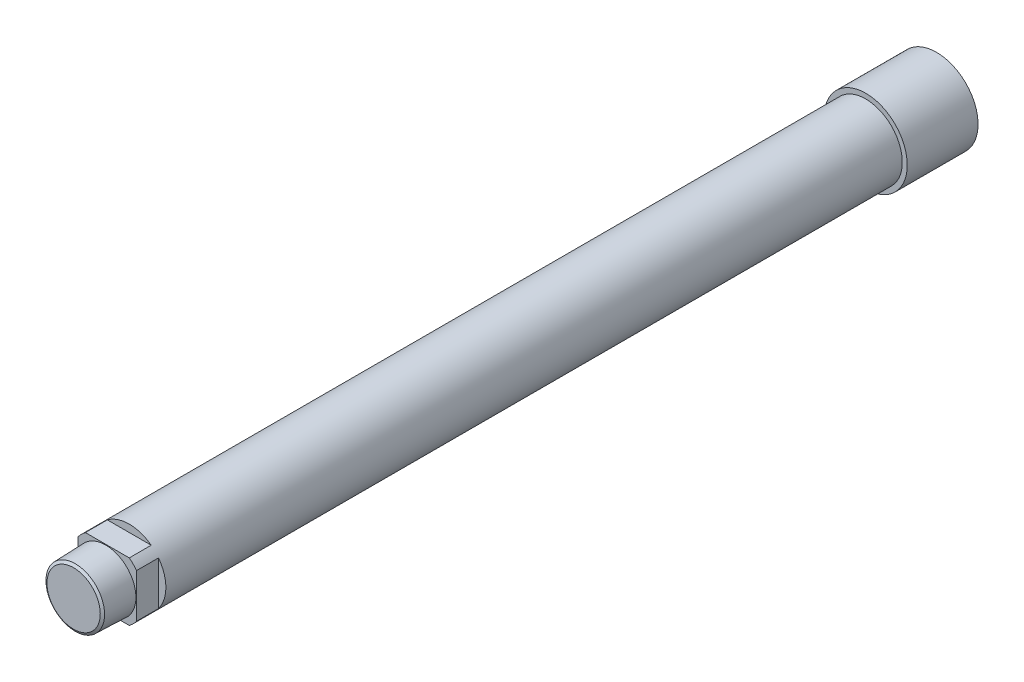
ISO-10303-21;
HEADER;
FILE_DESCRIPTION(('STEP AP214'),'2;1');
FILE_NAME('part.step','',(''),(''),'','','');
FILE_SCHEMA(('AUTOMOTIVE_DESIGN { 1 0 10303 214 1 1 1 1 }'));
ENDSEC;
DATA;
#1=APPLICATION_CONTEXT('core data for automotive mechanical design processes');
#2=APPLICATION_PROTOCOL_DEFINITION('international standard','automotive_design',2000,#1);
#3=PRODUCT_CONTEXT('',#1,'mechanical');
#4=PRODUCT('Part','Part','',(#3));
#5=PRODUCT_RELATED_PRODUCT_CATEGORY('part','',(#4));
#6=PRODUCT_DEFINITION_FORMATION('','',#4);
#7=PRODUCT_DEFINITION_CONTEXT('part definition',#1,'design');
#8=PRODUCT_DEFINITION('design','',#6,#7);
#9=PRODUCT_DEFINITION_SHAPE('','',#8);
#10=(LENGTH_UNIT() NAMED_UNIT(*) SI_UNIT(.MILLI.,.METRE.));
#11=(NAMED_UNIT(*) PLANE_ANGLE_UNIT() SI_UNIT($,.RADIAN.));
#12=(NAMED_UNIT(*) SI_UNIT($,.STERADIAN.) SOLID_ANGLE_UNIT());
#13=UNCERTAINTY_MEASURE_WITH_UNIT(LENGTH_MEASURE(1.E-05),#10,'distance_accuracy_value','');
#14=(GEOMETRIC_REPRESENTATION_CONTEXT(3) GLOBAL_UNCERTAINTY_ASSIGNED_CONTEXT((#13)) GLOBAL_UNIT_ASSIGNED_CONTEXT((#10,
#11,#12)) REPRESENTATION_CONTEXT('',''));
#15=CARTESIAN_POINT('',(0.,0.,0.));
#16=DIRECTION('',(0.,0.,1.));
#17=DIRECTION('',(1.,0.,0.));
#18=AXIS2_PLACEMENT_3D('',#15,#16,#17);
#19=CARTESIAN_POINT('',(0.,0.,343.789));
#20=DIRECTION('',(0.,0.,-1.));
#21=DIRECTION('',(-1.,0.,0.));
#22=AXIS2_PLACEMENT_3D('',#19,#20,#21);
#23=CYLINDRICAL_SURFACE('',#22,15.875);
#24=CARTESIAN_POINT('',(0.,0.,0.));
#25=DIRECTION('',(0.,0.,-1.));
#26=DIRECTION('',(-1.,0.,0.));
#27=AXIS2_PLACEMENT_3D('',#24,#25,#26);
#28=CIRCLE('',#27,15.875);
#29=CARTESIAN_POINT('',(-15.875,0.,0.));
#30=VERTEX_POINT('',#29);
#31=EDGE_CURVE('E204',#30,#30,#28,.T.);
#32=ORIENTED_EDGE('',*,*,#31,.F.);
#33=EDGE_LOOP('',(#32));
#34=FACE_BOUND('',#33,.T.);
#35=CARTESIAN_POINT('',(0.,0.,319.6336));
#36=DIRECTION('',(0.,0.,1.));
#37=DIRECTION('',(1.,0.,0.));
#38=AXIS2_PLACEMENT_3D('',#35,#36,#37);
#39=CIRCLE('',#38,15.875);
#40=CARTESIAN_POINT('',(9.52499999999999,12.7,319.6336));
#41=VERTEX_POINT('',#40);
#42=CARTESIAN_POINT('',(-9.52499999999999,12.7,319.6336));
#43=VERTEX_POINT('',#42);
#44=EDGE_CURVE('E49',#41,#43,#39,.T.);
#45=ORIENTED_EDGE('',*,*,#44,.F.);
#46=DIRECTION('',(0.,0.,-1.));
#47=VECTOR('',#46,1.);
#48=CARTESIAN_POINT('',(9.52499999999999,12.7,343.789));
#49=LINE('',#48,#47);
#50=CARTESIAN_POINT('',(9.52499999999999,12.7,329.1586));
#51=VERTEX_POINT('',#50);
#52=EDGE_CURVE('E160',#51,#41,#49,.T.);
#53=ORIENTED_EDGE('',*,*,#52,.F.);
#54=CARTESIAN_POINT('',(0.,0.,329.1586));
#55=DIRECTION('',(0.,0.,1.));
#56=DIRECTION('',(1.,0.,0.));
#57=AXIS2_PLACEMENT_3D('',#54,#55,#56);
#58=CIRCLE('',#57,15.875);
#59=CARTESIAN_POINT('',(12.7,9.525,329.1586));
#60=VERTEX_POINT('',#59);
#61=EDGE_CURVE('E128',#60,#51,#58,.T.);
#62=ORIENTED_EDGE('',*,*,#61,.F.);
#63=DIRECTION('',(0.,0.,-1.));
#64=VECTOR('',#63,1.);
#65=CARTESIAN_POINT('',(12.7,9.52500000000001,343.789));
#66=LINE('',#65,#64);
#67=CARTESIAN_POINT('',(12.7,9.52500000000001,319.6336));
#68=VERTEX_POINT('',#67);
#69=EDGE_CURVE('E121',#68,#60,#66,.F.);
#70=ORIENTED_EDGE('',*,*,#69,.F.);
#71=CARTESIAN_POINT('',(12.7,-9.52500000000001,319.6336));
#72=VERTEX_POINT('',#71);
#73=EDGE_CURVE('E141',#72,#68,#39,.T.);
#74=ORIENTED_EDGE('',*,*,#73,.F.);
#75=DIRECTION('',(0.,0.,-1.));
#76=VECTOR('',#75,1.);
#77=CARTESIAN_POINT('',(12.7,-9.52500000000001,343.789));
#78=LINE('',#77,#76);
#79=CARTESIAN_POINT('',(12.7,-9.525,329.1586));
#80=VERTEX_POINT('',#79);
#81=EDGE_CURVE('E161',#80,#72,#78,.T.);
#82=ORIENTED_EDGE('',*,*,#81,.F.);
#83=CARTESIAN_POINT('',(9.52500000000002,-12.7,329.1586));
#84=VERTEX_POINT('',#83);
#85=EDGE_CURVE('E126',#84,#80,#58,.T.);
#86=ORIENTED_EDGE('',*,*,#85,.F.);
#87=DIRECTION('',(0.,0.,-1.));
#88=VECTOR('',#87,1.);
#89=CARTESIAN_POINT('',(9.52500000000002,-12.7,343.789));
#90=LINE('',#89,#88);
#91=CARTESIAN_POINT('',(9.52500000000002,-12.7,319.6336));
#92=VERTEX_POINT('',#91);
#93=EDGE_CURVE('E109',#92,#84,#90,.F.);
#94=ORIENTED_EDGE('',*,*,#93,.F.);
#95=CARTESIAN_POINT('',(-9.52500000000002,-12.7,319.6336));
#96=VERTEX_POINT('',#95);
#97=EDGE_CURVE('E44',#96,#92,#39,.T.);
#98=ORIENTED_EDGE('',*,*,#97,.F.);
#99=DIRECTION('',(0.,0.,-1.));
#100=VECTOR('',#99,1.);
#101=CARTESIAN_POINT('',(-9.52500000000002,-12.7,343.789));
#102=LINE('',#101,#100);
#103=CARTESIAN_POINT('',(-9.52500000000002,-12.7,329.1586));
#104=VERTEX_POINT('',#103);
#105=EDGE_CURVE('E106',#104,#96,#102,.T.);
#106=ORIENTED_EDGE('',*,*,#105,.F.);
#107=CARTESIAN_POINT('',(-12.7,-9.525,329.1586));
#108=VERTEX_POINT('',#107);
#109=EDGE_CURVE('E119',#108,#104,#58,.T.);
#110=ORIENTED_EDGE('',*,*,#109,.F.);
#111=DIRECTION('',(0.,0.,-1.));
#112=VECTOR('',#111,1.);
#113=CARTESIAN_POINT('',(-12.7,-9.52500000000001,343.789));
#114=LINE('',#113,#112);
#115=CARTESIAN_POINT('',(-12.7,-9.52500000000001,319.6336));
#116=VERTEX_POINT('',#115);
#117=EDGE_CURVE('E163',#116,#108,#114,.F.);
#118=ORIENTED_EDGE('',*,*,#117,.F.);
#119=CARTESIAN_POINT('',(-12.7,9.52500000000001,319.6336));
#120=VERTEX_POINT('',#119);
#121=EDGE_CURVE('E12',#120,#116,#39,.T.);
#122=ORIENTED_EDGE('',*,*,#121,.F.);
#123=DIRECTION('',(0.,0.,-1.));
#124=VECTOR('',#123,1.);
#125=CARTESIAN_POINT('',(-12.7,9.52500000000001,343.789));
#126=LINE('',#125,#124);
#127=CARTESIAN_POINT('',(-12.7,9.525,329.1586));
#128=VERTEX_POINT('',#127);
#129=EDGE_CURVE('E169',#128,#120,#126,.T.);
#130=ORIENTED_EDGE('',*,*,#129,.F.);
#131=CARTESIAN_POINT('',(-9.52499999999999,12.7,329.1586));
#132=VERTEX_POINT('',#131);
#133=EDGE_CURVE('E125',#132,#128,#58,.T.);
#134=ORIENTED_EDGE('',*,*,#133,.F.);
#135=DIRECTION('',(0.,0.,-1.));
#136=VECTOR('',#135,1.);
#137=CARTESIAN_POINT('',(-9.52499999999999,12.7,343.789));
#138=LINE('',#137,#136);
#139=EDGE_CURVE('E157',#43,#132,#138,.F.);
#140=ORIENTED_EDGE('',*,*,#139,.F.);
#141=EDGE_LOOP('',(#45,#53,#62,#70,#74,#82,#86,#94,#98,#106,#110,#118,#122,#130,#134,#140));
#142=FACE_BOUND('',#141,.T.);
#143=ADVANCED_FACE('F41',(#34,#142),#23,.T.);
#144=CARTESIAN_POINT('',(0.,12.0243668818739,329.1586));
#145=DIRECTION('',(0.,0.,1.));
#146=DIRECTION('',(1.,0.,0.));
#147=AXIS2_PLACEMENT_3D('',#144,#145,#146);
#148=PLANE('',#147);
#149=DIRECTION('',(1.,0.,0.));
#150=VECTOR('',#149,1.);
#151=CARTESIAN_POINT('',(0.,-12.7,329.1586));
#152=LINE('',#151,#150);
#153=EDGE_CURVE('E56',#104,#84,#152,.T.);
#154=ORIENTED_EDGE('',*,*,#153,.T.);
#155=ORIENTED_EDGE('',*,*,#85,.T.);
#156=DIRECTION('',(0.,1.,0.));
#157=VECTOR('',#156,1.);
#158=CARTESIAN_POINT('',(12.7,12.0243668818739,329.1586));
#159=LINE('',#158,#157);
#160=EDGE_CURVE('E111',#80,#60,#159,.T.);
#161=ORIENTED_EDGE('',*,*,#160,.T.);
#162=ORIENTED_EDGE('',*,*,#61,.T.);
#163=DIRECTION('',(-1.,0.,0.));
#164=VECTOR('',#163,1.);
#165=CARTESIAN_POINT('',(0.,12.7,329.1586));
#166=LINE('',#165,#164);
#167=EDGE_CURVE('E140',#51,#132,#166,.T.);
#168=ORIENTED_EDGE('',*,*,#167,.T.);
#169=ORIENTED_EDGE('',*,*,#133,.T.);
#170=DIRECTION('',(0.,-1.,0.));
#171=VECTOR('',#170,1.);
#172=CARTESIAN_POINT('',(-12.7,12.0243668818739,329.1586));
#173=LINE('',#172,#171);
#174=EDGE_CURVE('E62',#128,#108,#173,.T.);
#175=ORIENTED_EDGE('',*,*,#174,.T.);
#176=ORIENTED_EDGE('',*,*,#109,.T.);
#177=EDGE_LOOP('',(#154,#155,#161,#162,#168,#169,#175,#176));
#178=FACE_BOUND('',#177,.T.);
#179=CARTESIAN_POINT('',(0.,0.,329.1586));
#180=DIRECTION('',(0.,0.,1.));
#181=DIRECTION('',(1.,0.,0.));
#182=AXIS2_PLACEMENT_3D('',#179,#180,#181);
#183=CIRCLE('',#182,12.0243668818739);
#184=CARTESIAN_POINT('',(12.0243668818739,0.,329.1586));
#185=VERTEX_POINT('',#184);
#186=EDGE_CURVE('E133',#185,#185,#183,.T.);
#187=ORIENTED_EDGE('',*,*,#186,.F.);
#188=EDGE_LOOP('',(#187));
#189=FACE_BOUND('',#188,.T.);
#190=ADVANCED_FACE('F123',(#178,#189),#148,.T.);
#191=CARTESIAN_POINT('',(0.,0.,330.073));
#192=DIRECTION('',(0.,0.,1.));
#193=DIRECTION('',(1.,0.,0.));
#194=AXIS2_PLACEMENT_3D('',#191,#192,#193);
#195=CONICAL_SURFACE('',#194,13.443750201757,0.998492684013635);
#196=ORIENTED_EDGE('',*,*,#186,.T.);
#197=EDGE_LOOP('',(#196));
#198=FACE_BOUND('',#197,.T.);
#199=CARTESIAN_POINT('',(0.,0.,329.87247368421));
#200=DIRECTION('',(0.,0.,-1.));
#201=DIRECTION('',(-1.,0.,0.));
#202=AXIS2_PLACEMENT_3D('',#199,#200,#201);
#203=CIRCLE('',#202,13.1324819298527);
#204=CARTESIAN_POINT('',(-13.1324819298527,0.,329.87247368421));
#205=VERTEX_POINT('',#204);
#206=EDGE_CURVE('E170',#205,#205,#203,.T.);
#207=ORIENTED_EDGE('',*,*,#206,.T.);
#208=EDGE_LOOP('',(#207));
#209=FACE_BOUND('',#208,.T.);
#210=ADVANCED_FACE('F201',(#198,#209),#195,.T.);
#211=CARTESIAN_POINT('',(-12.7,-12.7,319.6336));
#212=DIRECTION('',(0.,-1.,0.));
#213=DIRECTION('',(0.,0.,-1.));
#214=AXIS2_PLACEMENT_3D('',#211,#212,#213);
#215=PLANE('',#214);
#216=DIRECTION('',(1.,0.,0.));
#217=VECTOR('',#216,1.);
#218=CARTESIAN_POINT('',(-12.7,-12.7,319.6336));
#219=LINE('',#218,#217);
#220=EDGE_CURVE('E209',#96,#92,#219,.T.);
#221=ORIENTED_EDGE('',*,*,#220,.T.);
#222=ORIENTED_EDGE('',*,*,#93,.T.);
#223=ORIENTED_EDGE('',*,*,#153,.F.);
#224=ORIENTED_EDGE('',*,*,#105,.T.);
#225=EDGE_LOOP('',(#221,#222,#223,#224));
#226=FACE_BOUND('',#225,.T.);
#227=ADVANCED_FACE('F105',(#226),#215,.T.);
#228=CARTESIAN_POINT('',(0.,0.,319.6336));
#229=DIRECTION('',(0.,0.,1.));
#230=DIRECTION('',(1.,0.,0.));
#231=AXIS2_PLACEMENT_3D('',#228,#229,#230);
#232=PLANE('',#231);
#233=ORIENTED_EDGE('',*,*,#97,.T.);
#234=ORIENTED_EDGE('',*,*,#220,.F.);
#235=EDGE_LOOP('',(#233,#234));
#236=FACE_BOUND('',#235,.T.);
#237=ADVANCED_FACE('F228',(#236),#232,.T.);
#238=CARTESIAN_POINT('',(12.7,-12.7,319.6336));
#239=DIRECTION('',(1.,0.,0.));
#240=DIRECTION('',(0.,0.,-1.));
#241=AXIS2_PLACEMENT_3D('',#238,#239,#240);
#242=PLANE('',#241);
#243=DIRECTION('',(0.,1.,0.));
#244=VECTOR('',#243,1.);
#245=CARTESIAN_POINT('',(12.7,-12.7,319.6336));
#246=LINE('',#245,#244);
#247=EDGE_CURVE('E217',#72,#68,#246,.T.);
#248=ORIENTED_EDGE('',*,*,#247,.T.);
#249=ORIENTED_EDGE('',*,*,#69,.T.);
#250=ORIENTED_EDGE('',*,*,#160,.F.);
#251=ORIENTED_EDGE('',*,*,#81,.T.);
#252=EDGE_LOOP('',(#248,#249,#250,#251));
#253=FACE_BOUND('',#252,.T.);
#254=ADVANCED_FACE('F223',(#253),#242,.T.);
#255=ORIENTED_EDGE('',*,*,#73,.T.);
#256=ORIENTED_EDGE('',*,*,#247,.F.);
#257=EDGE_LOOP('',(#255,#256));
#258=FACE_BOUND('',#257,.T.);
#259=ADVANCED_FACE('F225',(#258),#232,.T.);
#260=CARTESIAN_POINT('',(-12.7,12.7,319.6336));
#261=DIRECTION('',(0.,1.,0.));
#262=DIRECTION('',(0.,0.,1.));
#263=AXIS2_PLACEMENT_3D('',#260,#261,#262);
#264=PLANE('',#263);
#265=DIRECTION('',(-1.,0.,0.));
#266=VECTOR('',#265,1.);
#267=CARTESIAN_POINT('',(-12.7,12.7,319.6336));
#268=LINE('',#267,#266);
#269=EDGE_CURVE('E153',#41,#43,#268,.T.);
#270=ORIENTED_EDGE('',*,*,#269,.T.);
#271=ORIENTED_EDGE('',*,*,#139,.T.);
#272=ORIENTED_EDGE('',*,*,#167,.F.);
#273=ORIENTED_EDGE('',*,*,#52,.T.);
#274=EDGE_LOOP('',(#270,#271,#272,#273));
#275=FACE_BOUND('',#274,.T.);
#276=ADVANCED_FACE('F227',(#275),#264,.T.);
#277=ORIENTED_EDGE('',*,*,#44,.T.);
#278=ORIENTED_EDGE('',*,*,#269,.F.);
#279=EDGE_LOOP('',(#277,#278));
#280=FACE_BOUND('',#279,.T.);
#281=ADVANCED_FACE('F152',(#280),#232,.T.);
#282=ORIENTED_EDGE('',*,*,#121,.T.);
#283=DIRECTION('',(0.,-1.,0.));
#284=VECTOR('',#283,1.);
#285=CARTESIAN_POINT('',(-12.7,-12.7,319.6336));
#286=LINE('',#285,#284);
#287=EDGE_CURVE('E206',#120,#116,#286,.T.);
#288=ORIENTED_EDGE('',*,*,#287,.F.);
#289=EDGE_LOOP('',(#282,#288));
#290=FACE_BOUND('',#289,.T.);
#291=ADVANCED_FACE('F237',(#290),#232,.T.);
#292=CARTESIAN_POINT('',(-12.7,-12.7,319.6336));
#293=DIRECTION('',(-1.,0.,0.));
#294=DIRECTION('',(0.,0.,1.));
#295=AXIS2_PLACEMENT_3D('',#292,#293,#294);
#296=PLANE('',#295);
#297=ORIENTED_EDGE('',*,*,#287,.T.);
#298=ORIENTED_EDGE('',*,*,#117,.T.);
#299=ORIENTED_EDGE('',*,*,#174,.F.);
#300=ORIENTED_EDGE('',*,*,#129,.T.);
#301=EDGE_LOOP('',(#297,#298,#299,#300));
#302=FACE_BOUND('',#301,.T.);
#303=ADVANCED_FACE('F244',(#302),#296,.T.);
#304=CARTESIAN_POINT('',(0.,0.,343.789));
#305=DIRECTION('',(0.,0.,1.));
#306=DIRECTION('',(1.,0.,0.));
#307=AXIS2_PLACEMENT_3D('',#304,#305,#306);
#308=PLANE('',#307);
#309=CARTESIAN_POINT('',(0.,0.,343.789));
#310=DIRECTION('',(0.,0.,1.));
#311=DIRECTION('',(1.,0.,0.));
#312=AXIS2_PLACEMENT_3D('',#309,#310,#311);
#313=CIRCLE('',#312,11.5697);
#314=CARTESIAN_POINT('',(11.5697,0.,343.789));
#315=VERTEX_POINT('',#314);
#316=EDGE_CURVE('E112',#315,#315,#313,.T.);
#317=ORIENTED_EDGE('',*,*,#316,.T.);
#318=EDGE_LOOP('',(#317));
#319=FACE_BOUND('',#318,.T.);
#320=ADVANCED_FACE('F191',(#319),#308,.T.);
#321=CARTESIAN_POINT('',(0.,0.,343.789));
#322=DIRECTION('',(0.,0.,-1.));
#323=DIRECTION('',(-1.,0.,0.));
#324=AXIS2_PLACEMENT_3D('',#321,#322,#323);
#325=CONICAL_SURFACE('',#324,11.5697,1.01621874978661);
#326=ORIENTED_EDGE('',*,*,#316,.F.);
#327=EDGE_LOOP('',(#326));
#328=FACE_BOUND('',#327,.T.);
#329=CARTESIAN_POINT('',(0.,0.,343.07512631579));
#330=DIRECTION('',(0.,0.,1.));
#331=DIRECTION('',(1.,0.,0.));
#332=AXIS2_PLACEMENT_3D('',#329,#330,#331);
#333=CIRCLE('',#332,12.7221849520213);
#334=CARTESIAN_POINT('',(12.7221849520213,0.,343.07512631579));
#335=VERTEX_POINT('',#334);
#336=EDGE_CURVE('E129',#335,#335,#333,.T.);
#337=ORIENTED_EDGE('',*,*,#336,.T.);
#338=EDGE_LOOP('',(#337));
#339=FACE_BOUND('',#338,.T.);
#340=ADVANCED_FACE('F177',(#328,#339),#325,.T.);
#341=CARTESIAN_POINT('',(0.,0.,343.789));
#342=DIRECTION('',(0.,0.,-1.));
#343=DIRECTION('',(-1.,0.,0.));
#344=AXIS2_PLACEMENT_3D('',#341,#342,#343);
#345=CONICAL_SURFACE('',#344,12.7,0.0310668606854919);
#346=ORIENTED_EDGE('',*,*,#336,.F.);
#347=EDGE_LOOP('',(#346));
#348=FACE_BOUND('',#347,.T.);
#349=ORIENTED_EDGE('',*,*,#206,.F.);
#350=EDGE_LOOP('',(#349));
#351=FACE_BOUND('',#350,.T.);
#352=ADVANCED_FACE('F179',(#348,#351),#345,.T.);
#353=CARTESIAN_POINT('',(0.,0.,0.));
#354=DIRECTION('',(0.,0.,-1.));
#355=DIRECTION('',(-1.,0.,0.));
#356=AXIS2_PLACEMENT_3D('',#353,#354,#355);
#357=PLANE('',#356);
#358=CARTESIAN_POINT('',(0.,0.,0.));
#359=DIRECTION('',(0.,0.,-1.));
#360=DIRECTION('',(-1.,0.,0.));
#361=AXIS2_PLACEMENT_3D('',#358,#359,#360);
#362=CIRCLE('',#361,18.034);
#363=CARTESIAN_POINT('',(-18.034,0.,0.));
#364=VERTEX_POINT('',#363);
#365=EDGE_CURVE('E212',#364,#364,#362,.T.);
#366=ORIENTED_EDGE('',*,*,#365,.F.);
#367=EDGE_LOOP('',(#366));
#368=FACE_BOUND('',#367,.T.);
#369=ORIENTED_EDGE('',*,*,#31,.T.);
#370=EDGE_LOOP('',(#369));
#371=FACE_BOUND('',#370,.T.);
#372=ADVANCED_FACE('F182',(#368,#371),#357,.F.);
#373=CARTESIAN_POINT('',(0.,0.,-30.734));
#374=DIRECTION('',(0.,0.,1.));
#375=DIRECTION('',(1.,0.,0.));
#376=AXIS2_PLACEMENT_3D('',#373,#374,#375);
#377=CYLINDRICAL_SURFACE('',#376,18.034);
#378=CARTESIAN_POINT('',(0.,0.,-30.734));
#379=DIRECTION('',(0.,0.,-1.));
#380=DIRECTION('',(-1.,0.,0.));
#381=AXIS2_PLACEMENT_3D('',#378,#379,#380);
#382=CIRCLE('',#381,18.034);
#383=CARTESIAN_POINT('',(-18.034,0.,-30.734));
#384=VERTEX_POINT('',#383);
#385=EDGE_CURVE('E207',#384,#384,#382,.T.);
#386=ORIENTED_EDGE('',*,*,#385,.F.);
#387=EDGE_LOOP('',(#386));
#388=FACE_BOUND('',#387,.T.);
#389=ORIENTED_EDGE('',*,*,#365,.T.);
#390=EDGE_LOOP('',(#389));
#391=FACE_BOUND('',#390,.T.);
#392=ADVANCED_FACE('F188',(#388,#391),#377,.T.);
#393=CARTESIAN_POINT('',(0.,0.,-30.734));
#394=DIRECTION('',(0.,0.,-1.));
#395=DIRECTION('',(-1.,0.,0.));
#396=AXIS2_PLACEMENT_3D('',#393,#394,#395);
#397=PLANE('',#396);
#398=CARTESIAN_POINT('',(0.,0.,-30.734));
#399=DIRECTION('',(0.,0.,-1.));
#400=DIRECTION('',(-1.,0.,0.));
#401=AXIS2_PLACEMENT_3D('',#398,#399,#400);
#402=CIRCLE('',#401,7.9375);
#403=CARTESIAN_POINT('',(-7.9375,0.,-30.734));
#404=VERTEX_POINT('',#403);
#405=EDGE_CURVE('E276',#404,#404,#402,.T.);
#406=ORIENTED_EDGE('',*,*,#405,.F.);
#407=EDGE_LOOP('',(#406));
#408=FACE_BOUND('',#407,.T.);
#409=ORIENTED_EDGE('',*,*,#385,.T.);
#410=EDGE_LOOP('',(#409));
#411=FACE_BOUND('',#410,.T.);
#412=ADVANCED_FACE('F258',(#408,#411),#397,.T.);
#413=CARTESIAN_POINT('',(0.,0.,200.025));
#414=DIRECTION('',(0.,0.,1.));
#415=DIRECTION('',(1.,0.,0.));
#416=AXIS2_PLACEMENT_3D('',#413,#414,#415);
#417=PLANE('',#416);
#418=CARTESIAN_POINT('',(0.,0.,200.025));
#419=DIRECTION('',(0.,0.,1.));
#420=DIRECTION('',(1.,0.,0.));
#421=AXIS2_PLACEMENT_3D('',#418,#419,#420);
#422=CIRCLE('',#421,7.9375);
#423=CARTESIAN_POINT('',(7.9375,0.,200.025));
#424=VERTEX_POINT('',#423);
#425=EDGE_CURVE('E279',#424,#424,#422,.F.);
#426=ORIENTED_EDGE('',*,*,#425,.T.);
#427=EDGE_LOOP('',(#426));
#428=FACE_BOUND('',#427,.T.);
#429=ADVANCED_FACE('F263',(#428),#417,.F.);
#430=CARTESIAN_POINT('',(0.,0.,366.239640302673));
#431=DIRECTION('',(0.,0.,-1.));
#432=DIRECTION('',(-1.,0.,0.));
#433=AXIS2_PLACEMENT_3D('',#430,#431,#432);
#434=CYLINDRICAL_SURFACE('',#433,7.9375);
#435=ORIENTED_EDGE('',*,*,#405,.T.);
#436=EDGE_LOOP('',(#435));
#437=FACE_BOUND('',#436,.T.);
#438=ORIENTED_EDGE('',*,*,#425,.F.);
#439=EDGE_LOOP('',(#438));
#440=FACE_BOUND('',#439,.T.);
#441=ADVANCED_FACE('F267',(#437,#440),#434,.F.);
#442=CLOSED_SHELL('',(#143,#190,#210,#227,#237,#254,#259,#276,#281,#291,#303,#320,#340,#352,
#372,#392,#412,#429,#441));
#443=MANIFOLD_SOLID_BREP('B2',#442);
#444=ADVANCED_BREP_SHAPE_REPRESENTATION('',(#18,#443),#14);
#445=SHAPE_DEFINITION_REPRESENTATION(#9,#444);
ENDSEC;
END-ISO-10303-21;
